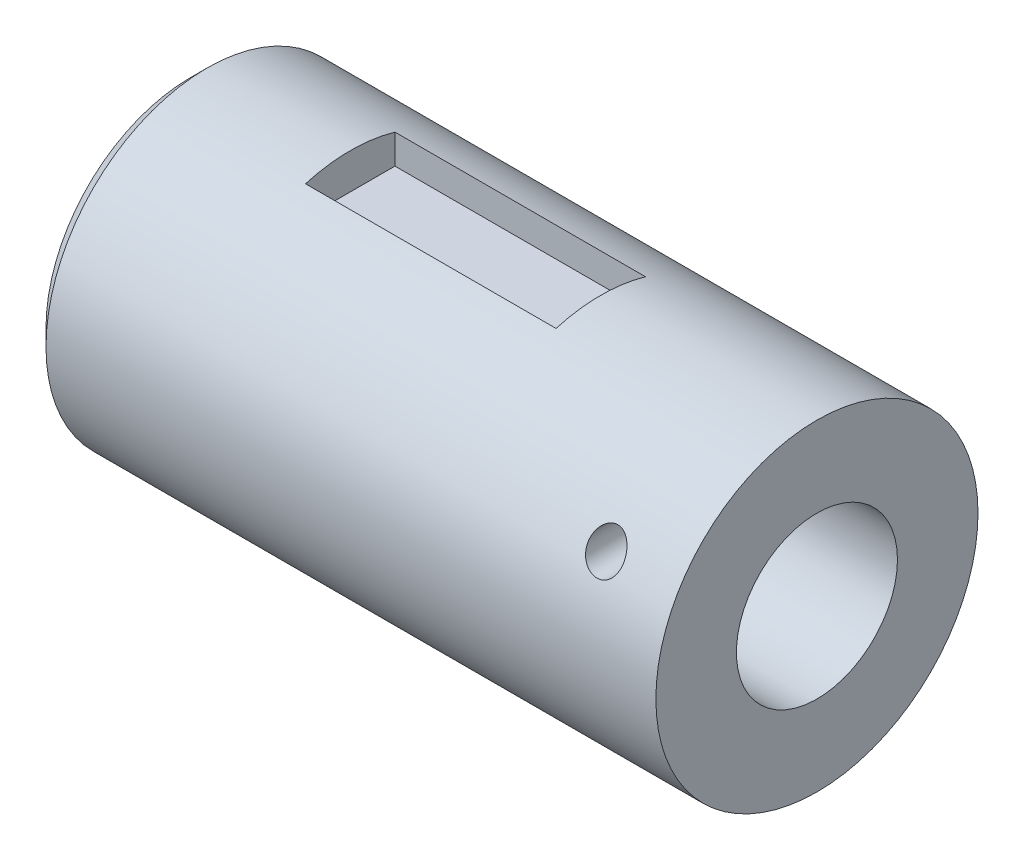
from build123d import *

# Parameters (mm, degrees)
CUT_EXTRUDE1_DEPTH      = 30
CUT_EXTRUDE1_DEPTH_BACK = 41
SKETCH2_R               = 2
SKETCH3_W               = 28
SKETCH3_H               = 10
CUT_EXTRUDE2_DEPTH      = 4


with BuildPart() as part:
    # Sketch1 → Revolve1 (revolve)
    with BuildSketch(Plane.XY, mode=Mode.PRIVATE) as revolve1_sk:
        Polygon((-59.402075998, 14), (-59.402075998, 16.159863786), (-57.561939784, 18), (10.597924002, 18), (10.597924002, 9), (-3.402075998, 9), (-3.402075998, 12), (-13.402075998, 12), (-13.402075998, 9), (-49.402075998, 9), (-49.402075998, 14), align=None)
    revolve(revolve1_sk.sketch.rotate(Axis((38.681885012, 0, 0), (-1, 0, 0)), 90), axis=Axis((38.681885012, 0, 0), (-1, 0, 0)))

    # Sketch2 → Cut-Extrude1 (cut, two sides: drawn at the far end of the back side and taken through both)
    with BuildSketch(Plane.XY.offset(-CUT_EXTRUDE1_DEPTH_BACK)):
        with Locations(Location((2.597924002, 9, 0), (0, 0, 180))):
            Circle(SKETCH2_R)
    extrude(amount=CUT_EXTRUDE1_DEPTH + CUT_EXTRUDE1_DEPTH_BACK, mode=Mode.SUBTRACT)

    # Sketch3 → Cut-Extrude2 (cut)
    with BuildSketch(Plane(origin=(0, 18, 0), x_dir=(1, 0, 0), z_dir=(0, 1, 0))):
        with Locations((-27.561939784, 0)):
            Rectangle(SKETCH3_W, SKETCH3_H)
    extrude(amount=-CUT_EXTRUDE2_DEPTH, mode=Mode.SUBTRACT)


solid = part.part
